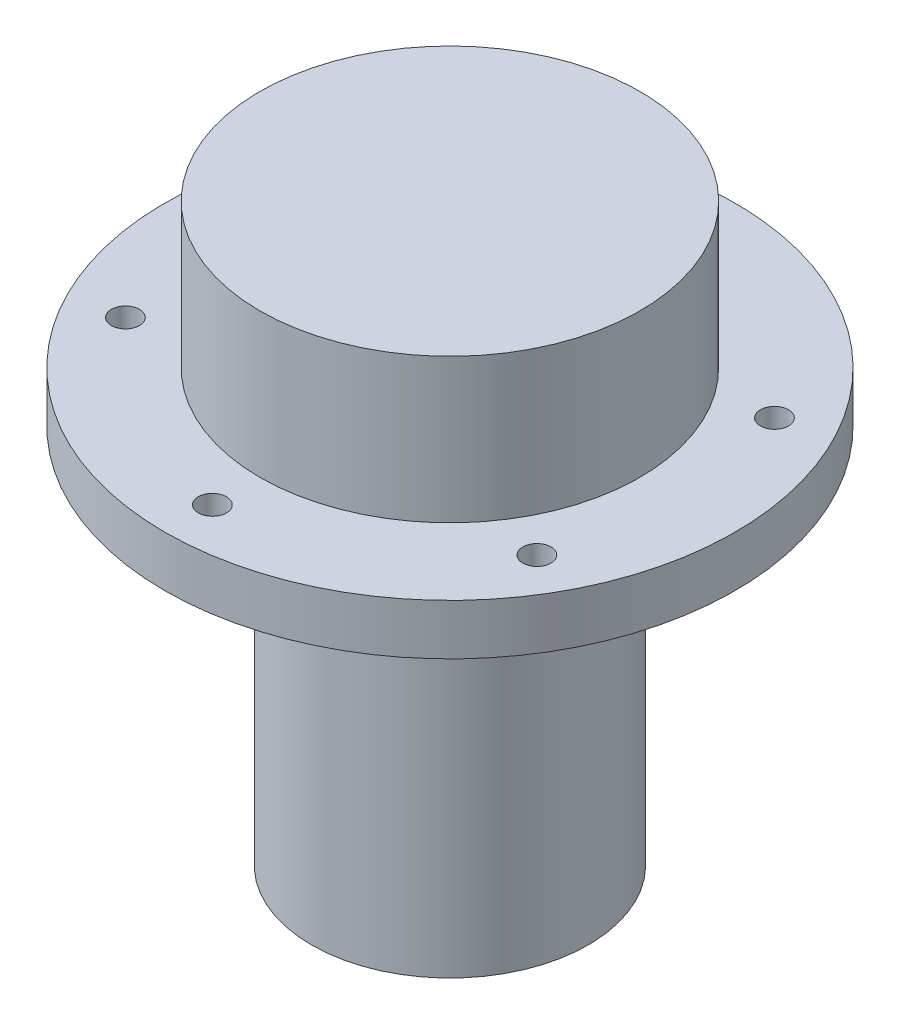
ISO-10303-21;
HEADER;
FILE_DESCRIPTION(('STEP AP214'),'2;1');
FILE_NAME('part.step','',(''),(''),'','','');
FILE_SCHEMA(('AUTOMOTIVE_DESIGN { 1 0 10303 214 1 1 1 1 }'));
ENDSEC;
DATA;
#1=APPLICATION_CONTEXT('core data for automotive mechanical design processes');
#2=APPLICATION_PROTOCOL_DEFINITION('international standard','automotive_design',2000,#1);
#3=PRODUCT_CONTEXT('',#1,'mechanical');
#4=PRODUCT('Part','Part','',(#3));
#5=PRODUCT_RELATED_PRODUCT_CATEGORY('part','',(#4));
#6=PRODUCT_DEFINITION_FORMATION('','',#4);
#7=PRODUCT_DEFINITION_CONTEXT('part definition',#1,'design');
#8=PRODUCT_DEFINITION('design','',#6,#7);
#9=PRODUCT_DEFINITION_SHAPE('','',#8);
#10=(LENGTH_UNIT() NAMED_UNIT(*) SI_UNIT(.MILLI.,.METRE.));
#11=(NAMED_UNIT(*) PLANE_ANGLE_UNIT() SI_UNIT($,.RADIAN.));
#12=(NAMED_UNIT(*) SI_UNIT($,.STERADIAN.) SOLID_ANGLE_UNIT());
#13=UNCERTAINTY_MEASURE_WITH_UNIT(LENGTH_MEASURE(1.E-05),#10,'distance_accuracy_value','');
#14=(GEOMETRIC_REPRESENTATION_CONTEXT(3) GLOBAL_UNCERTAINTY_ASSIGNED_CONTEXT((#13)) GLOBAL_UNIT_ASSIGNED_CONTEXT((#10,
#11,#12)) REPRESENTATION_CONTEXT('',''));
#15=CARTESIAN_POINT('',(0.,0.,0.));
#16=DIRECTION('',(0.,0.,1.));
#17=DIRECTION('',(1.,0.,0.));
#18=AXIS2_PLACEMENT_3D('',#15,#16,#17);
#19=CARTESIAN_POINT('',(0.,-76.2,0.));
#20=DIRECTION('',(0.,1.,0.));
#21=DIRECTION('',(0.,0.,1.));
#22=AXIS2_PLACEMENT_3D('',#19,#20,#21);
#23=CYLINDRICAL_SURFACE('',#22,27.7495);
#24=CARTESIAN_POINT('',(0.,-76.2,0.));
#25=DIRECTION('',(0.,1.,0.));
#26=DIRECTION('',(0.,0.,1.));
#27=AXIS2_PLACEMENT_3D('',#24,#25,#26);
#28=CIRCLE('',#27,27.7495);
#29=CARTESIAN_POINT('',(0.,-76.2,27.7495));
#30=VERTEX_POINT('',#29);
#31=EDGE_CURVE('E11',#30,#30,#28,.T.);
#32=CARTESIAN_POINT('',(0.,0.,0.));
#33=DIRECTION('',(0.,1.,0.));
#34=DIRECTION('',(0.,0.,1.));
#35=AXIS2_PLACEMENT_3D('',#32,#33,#34);
#36=CIRCLE('',#35,27.7495);
#37=CARTESIAN_POINT('',(0.,0.,27.7495));
#38=VERTEX_POINT('',#37);
#39=EDGE_CURVE('E42',#38,#38,#36,.T.);
#40=CARTESIAN_POINT('',(0.,-76.2,27.7495));
#41=CARTESIAN_POINT('',(0.,-75.40625,27.7495));
#42=CARTESIAN_POINT('',(0.,-74.6125,27.7495));
#43=CARTESIAN_POINT('',(0.,-73.025,27.7495));
#44=CARTESIAN_POINT('',(0.,-72.23125,27.7495));
#45=CARTESIAN_POINT('',(0.,-70.64375,27.7495));
#46=CARTESIAN_POINT('',(0.,-69.85,27.7495));
#47=CARTESIAN_POINT('',(0.,-68.2625,27.7495));
#48=CARTESIAN_POINT('',(0.,-67.46875,27.7495));
#49=CARTESIAN_POINT('',(0.,-65.88125,27.7495));
#50=CARTESIAN_POINT('',(0.,-65.0875,27.7495));
#51=CARTESIAN_POINT('',(0.,-63.5,27.7495));
#52=CARTESIAN_POINT('',(0.,-62.70625,27.7495));
#53=CARTESIAN_POINT('',(0.,-61.11875,27.7495));
#54=CARTESIAN_POINT('',(0.,-60.325,27.7495));
#55=CARTESIAN_POINT('',(0.,-58.7375,27.7495));
#56=CARTESIAN_POINT('',(0.,-57.94375,27.7495));
#57=CARTESIAN_POINT('',(0.,-56.35625,27.7495));
#58=CARTESIAN_POINT('',(0.,-55.5625,27.7495));
#59=CARTESIAN_POINT('',(0.,-53.975,27.7495));
#60=CARTESIAN_POINT('',(0.,-53.18125,27.7495));
#61=CARTESIAN_POINT('',(0.,-51.59375,27.7495));
#62=CARTESIAN_POINT('',(0.,-50.8,27.7495));
#63=CARTESIAN_POINT('',(0.,-49.2125,27.7495));
#64=CARTESIAN_POINT('',(0.,-48.41875,27.7495));
#65=CARTESIAN_POINT('',(0.,-46.83125,27.7495));
#66=CARTESIAN_POINT('',(0.,-46.0375,27.7495));
#67=CARTESIAN_POINT('',(0.,-44.45,27.7495));
#68=CARTESIAN_POINT('',(0.,-43.65625,27.7495));
#69=CARTESIAN_POINT('',(0.,-42.06875,27.7495));
#70=CARTESIAN_POINT('',(0.,-41.275,27.7495));
#71=CARTESIAN_POINT('',(0.,-39.6875,27.7495));
#72=CARTESIAN_POINT('',(0.,-38.89375,27.7495));
#73=CARTESIAN_POINT('',(0.,-37.30625,27.7495));
#74=CARTESIAN_POINT('',(0.,-36.5125,27.7495));
#75=CARTESIAN_POINT('',(0.,-34.925,27.7495));
#76=CARTESIAN_POINT('',(0.,-34.13125,27.7495));
#77=CARTESIAN_POINT('',(0.,-32.54375,27.7495));
#78=CARTESIAN_POINT('',(0.,-31.75,27.7495));
#79=CARTESIAN_POINT('',(0.,-30.1625,27.7495));
#80=CARTESIAN_POINT('',(0.,-29.36875,27.7495));
#81=CARTESIAN_POINT('',(0.,-27.78125,27.7495));
#82=CARTESIAN_POINT('',(0.,-26.9875,27.7495));
#83=CARTESIAN_POINT('',(0.,-25.4,27.7495));
#84=CARTESIAN_POINT('',(0.,-24.60625,27.7495));
#85=CARTESIAN_POINT('',(0.,-23.01875,27.7495));
#86=CARTESIAN_POINT('',(0.,-22.225,27.7495));
#87=CARTESIAN_POINT('',(0.,-20.6375,27.7495));
#88=CARTESIAN_POINT('',(0.,-19.84375,27.7495));
#89=CARTESIAN_POINT('',(0.,-18.25625,27.7495));
#90=CARTESIAN_POINT('',(0.,-17.4625,27.7495));
#91=CARTESIAN_POINT('',(0.,-15.875,27.7495));
#92=CARTESIAN_POINT('',(0.,-15.08125,27.7495));
#93=CARTESIAN_POINT('',(0.,-13.49375,27.7495));
#94=CARTESIAN_POINT('',(0.,-12.7,27.7495));
#95=CARTESIAN_POINT('',(0.,-11.1125,27.7495));
#96=CARTESIAN_POINT('',(0.,-10.31875,27.7495));
#97=CARTESIAN_POINT('',(0.,-8.73125,27.7495));
#98=CARTESIAN_POINT('',(0.,-7.93750000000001,27.7495));
#99=CARTESIAN_POINT('',(0.,-6.35,27.7495));
#100=CARTESIAN_POINT('',(0.,-5.55625,27.7495));
#101=CARTESIAN_POINT('',(0.,-3.96875,27.7495));
#102=CARTESIAN_POINT('',(0.,-3.175,27.7495));
#103=CARTESIAN_POINT('',(0.,-1.5875,27.7495));
#104=CARTESIAN_POINT('',(0.,-0.793750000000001,27.7495));
#105=CARTESIAN_POINT('',(0.,0.,27.7495));
#106=B_SPLINE_CURVE_WITH_KNOTS('',3,(#40,#41,#42,#43,#44,#45,#46,#47,#48,#49,#50,#51,#52,#53,
#54,#55,#56,#57,#58,#59,#60,#61,#62,#63,#64,#65,#66,#67,#68,#69,#70,#71,#72,#73,#74,#75,#76,#77,
#78,#79,#80,#81,#82,#83,#84,#85,#86,#87,#88,#89,#90,#91,#92,#93,#94,#95,#96,#97,#98,#99,#100,
#101,#102,#103,#104,#105),.UNSPECIFIED.,.F.,.F.,(4,2,2,2,2,2,2,2,2,2,2,2,2,2,2,2,2,2,2,2,2,2,2,
2,2,2,2,2,2,2,2,2,4),(0.,2.38124999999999,4.76249999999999,7.14374999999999,9.52499999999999,
11.90625,14.2875,16.66875,19.05,21.43125,23.8125,26.19375,28.575,30.95625,33.3375,35.71875,38.1,
40.48125,42.8625,45.24375,47.625,50.00625,52.3875,54.76875,57.15,59.53125,61.9125,64.29375,
66.675,69.05625,71.4375,73.81875,76.2),.UNSPECIFIED.);
#107=EDGE_CURVE('BSEAM39',#30,#38,#106,.T.);
#108=ORIENTED_EDGE('',*,*,#31,.T.);
#109=ORIENTED_EDGE('',*,*,#39,.F.);
#110=ORIENTED_EDGE('',*,*,#107,.T.);
#111=ORIENTED_EDGE('',*,*,#107,.F.);
#112=EDGE_LOOP('',(#108,#110,#109,#111));
#113=FACE_BOUND('',#112,.T.);
#114=ADVANCED_FACE('F39',(#113),#23,.T.);
#115=CARTESIAN_POINT('',(0.,-76.2,0.));
#116=DIRECTION('',(0.,1.,0.));
#117=DIRECTION('',(0.,0.,1.));
#118=AXIS2_PLACEMENT_3D('',#115,#116,#117);
#119=PLANE('',#118);
#120=ORIENTED_EDGE('',*,*,#31,.F.);
#121=EDGE_LOOP('',(#120));
#122=FACE_BOUND('',#121,.T.);
#123=ADVANCED_FACE('F54',(#122),#119,.F.);
#124=CARTESIAN_POINT('',(0.,0.,0.));
#125=DIRECTION('',(0.,1.,0.));
#126=DIRECTION('',(0.,0.,1.));
#127=AXIS2_PLACEMENT_3D('',#124,#125,#126);
#128=PLANE('',#127);
#129=ORIENTED_EDGE('',*,*,#39,.T.);
#130=EDGE_LOOP('',(#129));
#131=FACE_BOUND('',#130,.T.);
#132=ADVANCED_FACE('F51',(#131),#128,.T.);
#133=CLOSED_SHELL('',(#114,#123,#132));
#134=MANIFOLD_SOLID_BREP('B2',#133);
#135=CARTESIAN_POINT('',(0.,10.16,0.));
#136=DIRECTION('',(0.,1.,0.));
#137=DIRECTION('',(0.,0.,1.));
#138=AXIS2_PLACEMENT_3D('',#135,#136,#137);
#139=PLANE('',#138);
#140=CARTESIAN_POINT('',(0.,10.16,0.));
#141=DIRECTION('',(0.,1.,0.));
#142=DIRECTION('',(0.,0.,1.));
#143=AXIS2_PLACEMENT_3D('',#140,#141,#142);
#144=CIRCLE('',#143,38.1);
#145=CARTESIAN_POINT('',(0.,10.16,38.1));
#146=VERTEX_POINT('',#145);
#147=EDGE_CURVE('E135',#146,#146,#144,.T.);
#148=ORIENTED_EDGE('',*,*,#147,.F.);
#149=EDGE_LOOP('',(#148));
#150=FACE_BOUND('',#149,.T.);
#151=CARTESIAN_POINT('',(-41.2444598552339,10.16,23.8124999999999));
#152=DIRECTION('',(0.,1.,0.));
#153=DIRECTION('',(0.,0.,1.));
#154=AXIS2_PLACEMENT_3D('',#151,#152,#153);
#155=CIRCLE('',#154,2.8194);
#156=CARTESIAN_POINT('',(-41.2444598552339,10.16,26.6318999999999));
#157=VERTEX_POINT('',#156);
#158=EDGE_CURVE('E117',#157,#157,#155,.T.);
#159=ORIENTED_EDGE('',*,*,#158,.F.);
#160=EDGE_LOOP('',(#159));
#161=FACE_BOUND('',#160,.T.);
#162=CARTESIAN_POINT('',(41.2444598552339,10.16,23.8124999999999));
#163=DIRECTION('',(0.,1.,0.));
#164=DIRECTION('',(0.,0.,1.));
#165=AXIS2_PLACEMENT_3D('',#162,#163,#164);
#166=CIRCLE('',#165,2.8194);
#167=CARTESIAN_POINT('',(41.2444598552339,10.16,26.6318999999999));
#168=VERTEX_POINT('',#167);
#169=EDGE_CURVE('E105',#168,#168,#166,.T.);
#170=ORIENTED_EDGE('',*,*,#169,.F.);
#171=EDGE_LOOP('',(#170));
#172=FACE_BOUND('',#171,.T.);
#173=CARTESIAN_POINT('',(0.,10.16,-47.625));
#174=DIRECTION('',(0.,1.,0.));
#175=DIRECTION('',(0.,0.,1.));
#176=AXIS2_PLACEMENT_3D('',#173,#174,#175);
#177=CIRCLE('',#176,2.8194);
#178=CARTESIAN_POINT('',(0.,10.16,-44.8056));
#179=VERTEX_POINT('',#178);
#180=EDGE_CURVE('E95',#179,#179,#177,.T.);
#181=ORIENTED_EDGE('',*,*,#180,.F.);
#182=EDGE_LOOP('',(#181));
#183=FACE_BOUND('',#182,.T.);
#184=CARTESIAN_POINT('',(0.,10.16,0.));
#185=DIRECTION('',(0.,1.,0.));
#186=DIRECTION('',(0.,0.,1.));
#187=AXIS2_PLACEMENT_3D('',#184,#185,#186);
#188=CIRCLE('',#187,57.15);
#189=CARTESIAN_POINT('',(0.,10.16,57.15));
#190=VERTEX_POINT('',#189);
#191=EDGE_CURVE('E38',#190,#190,#188,.T.);
#192=ORIENTED_EDGE('',*,*,#191,.T.);
#193=EDGE_LOOP('',(#192));
#194=FACE_BOUND('',#193,.T.);
#195=CARTESIAN_POINT('',(41.2444598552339,10.16,-23.8124999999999));
#196=DIRECTION('',(0.,1.,0.));
#197=DIRECTION('',(0.,0.,1.));
#198=AXIS2_PLACEMENT_3D('',#195,#196,#197);
#199=CIRCLE('',#198,2.8194);
#200=CARTESIAN_POINT('',(41.2444598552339,10.16,-20.9930999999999));
#201=VERTEX_POINT('',#200);
#202=EDGE_CURVE('E99',#201,#201,#199,.T.);
#203=ORIENTED_EDGE('',*,*,#202,.F.);
#204=EDGE_LOOP('',(#203));
#205=FACE_BOUND('',#204,.T.);
#206=CARTESIAN_POINT('',(0.,10.16,47.625));
#207=DIRECTION('',(0.,1.,0.));
#208=DIRECTION('',(0.,0.,1.));
#209=AXIS2_PLACEMENT_3D('',#206,#207,#208);
#210=CIRCLE('',#209,2.8194);
#211=CARTESIAN_POINT('',(0.,10.16,50.4444));
#212=VERTEX_POINT('',#211);
#213=EDGE_CURVE('E111',#212,#212,#210,.T.);
#214=ORIENTED_EDGE('',*,*,#213,.F.);
#215=EDGE_LOOP('',(#214));
#216=FACE_BOUND('',#215,.T.);
#217=CARTESIAN_POINT('',(-41.244459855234,10.16,-23.8124999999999));
#218=DIRECTION('',(0.,1.,0.));
#219=DIRECTION('',(0.,0.,1.));
#220=AXIS2_PLACEMENT_3D('',#217,#218,#219);
#221=CIRCLE('',#220,2.8194);
#222=CARTESIAN_POINT('',(-41.244459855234,10.16,-20.9930999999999));
#223=VERTEX_POINT('',#222);
#224=EDGE_CURVE('E123',#223,#223,#221,.T.);
#225=ORIENTED_EDGE('',*,*,#224,.F.);
#226=EDGE_LOOP('',(#225));
#227=FACE_BOUND('',#226,.T.);
#228=ADVANCED_FACE('F80',(#150,#161,#172,#183,#194,#205,#216,#227),#139,.T.);
#229=CARTESIAN_POINT('',(0.,0.,0.));
#230=DIRECTION('',(0.,1.,0.));
#231=DIRECTION('',(0.,0.,1.));
#232=AXIS2_PLACEMENT_3D('',#229,#230,#231);
#233=PLANE('',#232);
#234=CARTESIAN_POINT('',(0.,0.,0.));
#235=DIRECTION('',(0.,1.,0.));
#236=DIRECTION('',(0.,0.,1.));
#237=AXIS2_PLACEMENT_3D('',#234,#235,#236);
#238=CIRCLE('',#237,57.15);
#239=CARTESIAN_POINT('',(0.,0.,57.15));
#240=VERTEX_POINT('',#239);
#241=EDGE_CURVE('E84',#240,#240,#238,.T.);
#242=ORIENTED_EDGE('',*,*,#241,.F.);
#243=EDGE_LOOP('',(#242));
#244=FACE_BOUND('',#243,.T.);
#245=CARTESIAN_POINT('',(0.,0.,0.));
#246=DIRECTION('',(0.,1.,0.));
#247=DIRECTION('',(0.,0.,1.));
#248=AXIS2_PLACEMENT_3D('',#245,#246,#247);
#249=CIRCLE('',#248,27.7495);
#250=CARTESIAN_POINT('',(0.,0.,27.7495));
#251=VERTEX_POINT('',#250);
#252=EDGE_CURVE('E91',#251,#251,#249,.T.);
#253=ORIENTED_EDGE('',*,*,#252,.T.);
#254=EDGE_LOOP('',(#253));
#255=FACE_BOUND('',#254,.T.);
#256=CARTESIAN_POINT('',(0.,0.,-47.625));
#257=DIRECTION('',(0.,1.,0.));
#258=DIRECTION('',(0.,0.,1.));
#259=AXIS2_PLACEMENT_3D('',#256,#257,#258);
#260=CIRCLE('',#259,2.8194);
#261=CARTESIAN_POINT('',(0.,0.,-44.8056));
#262=VERTEX_POINT('',#261);
#263=EDGE_CURVE('E96',#262,#262,#260,.T.);
#264=ORIENTED_EDGE('',*,*,#263,.T.);
#265=EDGE_LOOP('',(#264));
#266=FACE_BOUND('',#265,.T.);
#267=CARTESIAN_POINT('',(41.2444598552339,0.,-23.8124999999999));
#268=DIRECTION('',(0.,1.,0.));
#269=DIRECTION('',(0.,0.,1.));
#270=AXIS2_PLACEMENT_3D('',#267,#268,#269);
#271=CIRCLE('',#270,2.8194);
#272=CARTESIAN_POINT('',(41.2444598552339,0.,-20.9930999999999));
#273=VERTEX_POINT('',#272);
#274=EDGE_CURVE('E102',#273,#273,#271,.T.);
#275=ORIENTED_EDGE('',*,*,#274,.T.);
#276=EDGE_LOOP('',(#275));
#277=FACE_BOUND('',#276,.T.);
#278=CARTESIAN_POINT('',(41.2444598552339,0.,23.8124999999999));
#279=DIRECTION('',(0.,1.,0.));
#280=DIRECTION('',(0.,0.,1.));
#281=AXIS2_PLACEMENT_3D('',#278,#279,#280);
#282=CIRCLE('',#281,2.8194);
#283=CARTESIAN_POINT('',(41.2444598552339,0.,26.6318999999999));
#284=VERTEX_POINT('',#283);
#285=EDGE_CURVE('E108',#284,#284,#282,.T.);
#286=ORIENTED_EDGE('',*,*,#285,.T.);
#287=EDGE_LOOP('',(#286));
#288=FACE_BOUND('',#287,.T.);
#289=CARTESIAN_POINT('',(0.,0.,47.625));
#290=DIRECTION('',(0.,1.,0.));
#291=DIRECTION('',(0.,0.,1.));
#292=AXIS2_PLACEMENT_3D('',#289,#290,#291);
#293=CIRCLE('',#292,2.8194);
#294=CARTESIAN_POINT('',(0.,0.,50.4444));
#295=VERTEX_POINT('',#294);
#296=EDGE_CURVE('E114',#295,#295,#293,.T.);
#297=ORIENTED_EDGE('',*,*,#296,.T.);
#298=EDGE_LOOP('',(#297));
#299=FACE_BOUND('',#298,.T.);
#300=CARTESIAN_POINT('',(-41.2444598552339,0.,23.8124999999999));
#301=DIRECTION('',(0.,1.,0.));
#302=DIRECTION('',(0.,0.,1.));
#303=AXIS2_PLACEMENT_3D('',#300,#301,#302);
#304=CIRCLE('',#303,2.8194);
#305=CARTESIAN_POINT('',(-41.2444598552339,0.,26.6318999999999));
#306=VERTEX_POINT('',#305);
#307=EDGE_CURVE('E120',#306,#306,#304,.T.);
#308=ORIENTED_EDGE('',*,*,#307,.T.);
#309=EDGE_LOOP('',(#308));
#310=FACE_BOUND('',#309,.T.);
#311=CARTESIAN_POINT('',(-41.244459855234,0.,-23.8124999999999));
#312=DIRECTION('',(0.,1.,0.));
#313=DIRECTION('',(0.,0.,1.));
#314=AXIS2_PLACEMENT_3D('',#311,#312,#313);
#315=CIRCLE('',#314,2.8194);
#316=CARTESIAN_POINT('',(-41.244459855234,0.,-20.9930999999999));
#317=VERTEX_POINT('',#316);
#318=EDGE_CURVE('E126',#317,#317,#315,.T.);
#319=ORIENTED_EDGE('',*,*,#318,.T.);
#320=EDGE_LOOP('',(#319));
#321=FACE_BOUND('',#320,.T.);
#322=ADVANCED_FACE('F152',(#244,#255,#266,#277,#288,#299,#310,#321),#233,.F.);
#323=CARTESIAN_POINT('',(0.,10.16,0.));
#324=DIRECTION('',(0.,-1.,0.));
#325=DIRECTION('',(0.,0.,-1.));
#326=AXIS2_PLACEMENT_3D('',#323,#324,#325);
#327=CYLINDRICAL_SURFACE('',#326,57.15);
#328=ORIENTED_EDGE('',*,*,#191,.F.);
#329=EDGE_LOOP('',(#328));
#330=FACE_BOUND('',#329,.T.);
#331=ORIENTED_EDGE('',*,*,#241,.T.);
#332=EDGE_LOOP('',(#331));
#333=FACE_BOUND('',#332,.T.);
#334=ADVANCED_FACE('F82',(#330,#333),#327,.T.);
#335=CARTESIAN_POINT('',(0.,10.16,0.));
#336=DIRECTION('',(0.,-1.,0.));
#337=DIRECTION('',(0.,0.,-1.));
#338=AXIS2_PLACEMENT_3D('',#335,#336,#337);
#339=CYLINDRICAL_SURFACE('',#338,27.7495);
#340=CARTESIAN_POINT('',(0.,10.16,0.));
#341=DIRECTION('',(0.,1.,0.));
#342=DIRECTION('',(0.,0.,1.));
#343=AXIS2_PLACEMENT_3D('',#340,#341,#342);
#344=CIRCLE('',#343,27.7495);
#345=CARTESIAN_POINT('',(0.,10.16,27.7495));
#346=VERTEX_POINT('',#345);
#347=EDGE_CURVE('E129',#346,#346,#344,.T.);
#348=ORIENTED_EDGE('',*,*,#347,.T.);
#349=EDGE_LOOP('',(#348));
#350=FACE_BOUND('',#349,.T.);
#351=ORIENTED_EDGE('',*,*,#252,.F.);
#352=EDGE_LOOP('',(#351));
#353=FACE_BOUND('',#352,.T.);
#354=ADVANCED_FACE('F178',(#350,#353),#339,.F.);
#355=CARTESIAN_POINT('',(0.,10.16,-47.625));
#356=DIRECTION('',(0.,-1.,0.));
#357=DIRECTION('',(0.,0.,-1.));
#358=AXIS2_PLACEMENT_3D('',#355,#356,#357);
#359=CYLINDRICAL_SURFACE('',#358,2.8194);
#360=ORIENTED_EDGE('',*,*,#180,.T.);
#361=EDGE_LOOP('',(#360));
#362=FACE_BOUND('',#361,.T.);
#363=ORIENTED_EDGE('',*,*,#263,.F.);
#364=EDGE_LOOP('',(#363));
#365=FACE_BOUND('',#364,.T.);
#366=ADVANCED_FACE('F185',(#362,#365),#359,.F.);
#367=CARTESIAN_POINT('',(41.2444598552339,10.16,-23.8124999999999));
#368=DIRECTION('',(0.,-1.,0.));
#369=DIRECTION('',(0.,0.,-1.));
#370=AXIS2_PLACEMENT_3D('',#367,#368,#369);
#371=CYLINDRICAL_SURFACE('',#370,2.8194);
#372=ORIENTED_EDGE('',*,*,#202,.T.);
#373=EDGE_LOOP('',(#372));
#374=FACE_BOUND('',#373,.T.);
#375=ORIENTED_EDGE('',*,*,#274,.F.);
#376=EDGE_LOOP('',(#375));
#377=FACE_BOUND('',#376,.T.);
#378=ADVANCED_FACE('F189',(#374,#377),#371,.F.);
#379=CARTESIAN_POINT('',(41.2444598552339,10.16,23.8124999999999));
#380=DIRECTION('',(0.,-1.,0.));
#381=DIRECTION('',(0.,0.,-1.));
#382=AXIS2_PLACEMENT_3D('',#379,#380,#381);
#383=CYLINDRICAL_SURFACE('',#382,2.8194);
#384=ORIENTED_EDGE('',*,*,#169,.T.);
#385=EDGE_LOOP('',(#384));
#386=FACE_BOUND('',#385,.T.);
#387=ORIENTED_EDGE('',*,*,#285,.F.);
#388=EDGE_LOOP('',(#387));
#389=FACE_BOUND('',#388,.T.);
#390=ADVANCED_FACE('F193',(#386,#389),#383,.F.);
#391=CARTESIAN_POINT('',(0.,10.16,47.625));
#392=DIRECTION('',(0.,-1.,0.));
#393=DIRECTION('',(0.,0.,-1.));
#394=AXIS2_PLACEMENT_3D('',#391,#392,#393);
#395=CYLINDRICAL_SURFACE('',#394,2.8194);
#396=ORIENTED_EDGE('',*,*,#213,.T.);
#397=EDGE_LOOP('',(#396));
#398=FACE_BOUND('',#397,.T.);
#399=ORIENTED_EDGE('',*,*,#296,.F.);
#400=EDGE_LOOP('',(#399));
#401=FACE_BOUND('',#400,.T.);
#402=ADVANCED_FACE('F197',(#398,#401),#395,.F.);
#403=CARTESIAN_POINT('',(-41.2444598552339,10.16,23.8124999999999));
#404=DIRECTION('',(0.,-1.,0.));
#405=DIRECTION('',(0.,0.,-1.));
#406=AXIS2_PLACEMENT_3D('',#403,#404,#405);
#407=CYLINDRICAL_SURFACE('',#406,2.8194);
#408=ORIENTED_EDGE('',*,*,#158,.T.);
#409=EDGE_LOOP('',(#408));
#410=FACE_BOUND('',#409,.T.);
#411=ORIENTED_EDGE('',*,*,#307,.F.);
#412=EDGE_LOOP('',(#411));
#413=FACE_BOUND('',#412,.T.);
#414=ADVANCED_FACE('F169',(#410,#413),#407,.F.);
#415=CARTESIAN_POINT('',(-41.244459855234,10.16,-23.8124999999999));
#416=DIRECTION('',(0.,-1.,0.));
#417=DIRECTION('',(0.,0.,-1.));
#418=AXIS2_PLACEMENT_3D('',#415,#416,#417);
#419=CYLINDRICAL_SURFACE('',#418,2.8194);
#420=ORIENTED_EDGE('',*,*,#224,.T.);
#421=EDGE_LOOP('',(#420));
#422=FACE_BOUND('',#421,.T.);
#423=ORIENTED_EDGE('',*,*,#318,.F.);
#424=EDGE_LOOP('',(#423));
#425=FACE_BOUND('',#424,.T.);
#426=ADVANCED_FACE('F166',(#422,#425),#419,.F.);
#427=CARTESIAN_POINT('',(0.,10.16,0.));
#428=DIRECTION('',(0.,1.,0.));
#429=DIRECTION('',(0.,0.,1.));
#430=AXIS2_PLACEMENT_3D('',#427,#428,#429);
#431=PLANE('',#430);
#432=ORIENTED_EDGE('',*,*,#347,.F.);
#433=EDGE_LOOP('',(#432));
#434=FACE_BOUND('',#433,.T.);
#435=ADVANCED_FACE('F146',(#434),#431,.F.);
#436=CARTESIAN_POINT('',(0.,39.0652,0.));
#437=DIRECTION('',(0.,-1.,0.));
#438=DIRECTION('',(0.,0.,-1.));
#439=AXIS2_PLACEMENT_3D('',#436,#437,#438);
#440=CYLINDRICAL_SURFACE('',#439,38.1);
#441=CARTESIAN_POINT('',(0.,39.0652,0.));
#442=DIRECTION('',(0.,1.,0.));
#443=DIRECTION('',(0.,0.,1.));
#444=AXIS2_PLACEMENT_3D('',#441,#442,#443);
#445=CIRCLE('',#444,38.1);
#446=CARTESIAN_POINT('',(0.,39.0652,38.1));
#447=VERTEX_POINT('',#446);
#448=EDGE_CURVE('E134',#447,#447,#445,.T.);
#449=ORIENTED_EDGE('',*,*,#448,.F.);
#450=EDGE_LOOP('',(#449));
#451=FACE_BOUND('',#450,.T.);
#452=ORIENTED_EDGE('',*,*,#147,.T.);
#453=EDGE_LOOP('',(#452));
#454=FACE_BOUND('',#453,.T.);
#455=ADVANCED_FACE('F143',(#451,#454),#440,.T.);
#456=CARTESIAN_POINT('',(0.,39.0652,0.));
#457=DIRECTION('',(0.,1.,0.));
#458=DIRECTION('',(0.,0.,1.));
#459=AXIS2_PLACEMENT_3D('',#456,#457,#458);
#460=PLANE('',#459);
#461=ORIENTED_EDGE('',*,*,#448,.T.);
#462=EDGE_LOOP('',(#461));
#463=FACE_BOUND('',#462,.T.);
#464=ADVANCED_FACE('F141',(#463),#460,.T.);
#465=CLOSED_SHELL('',(#228,#322,#334,#354,#366,#378,#390,#402,#414,#426,#435,#455,#464));
#466=MANIFOLD_SOLID_BREP('B6',#465);
#467=ADVANCED_BREP_SHAPE_REPRESENTATION('',(#18,#134,#466),#14);
#468=SHAPE_DEFINITION_REPRESENTATION(#9,#467);
ENDSEC;
END-ISO-10303-21;
